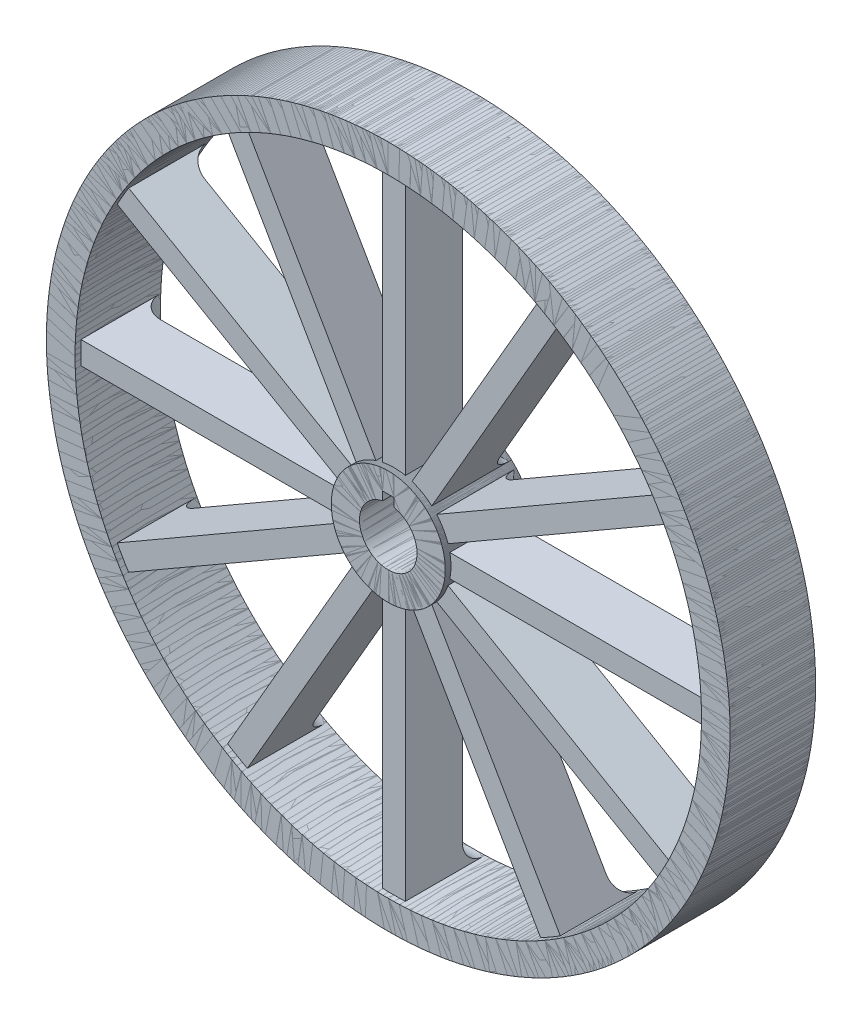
from build123d import *

# Parameters (mm, degrees)
SKETCH_1_R               = 60
SKETCH_1_R_2             = 55
EXTRUDE_1_DEPTH          = 15
SKETCH_1_R_3             = 10
SKETCH_1_R_4             = 5.05
EXTRUDE_1_2_DEPTH        = 15
EXTRUDE_2_DEPTH          = 14
CUT_EXTRUDE_1_DEPTH      = 4
PATTERN_CIRCULAR_1_COUNT = 12
CUT_EXTRUDE_2_DEPTH      = 97.184610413


with BuildPart() as part:
    # Sketch 1 → Extrude 1 (new body)
    with BuildSketch(Plane.XY):
        with Locations((-11.767184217, 2.257132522)):
            Circle(SKETCH_1_R)
        with Locations((-11.767184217, 2.257132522)):
            Circle(SKETCH_1_R_2, mode=Mode.SUBTRACT)
    extrude(amount=EXTRUDE_1_DEPTH)



with BuildPart() as body_2:
    # Sketch 1 → Extrude 1 2 (new body)
    with BuildSketch(Plane.XY):
        with Locations((-11.767184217, 2.257132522)):
            Circle(SKETCH_1_R_3)
        with Locations((-11.767184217, 2.257132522)):
            Circle(SKETCH_1_R_4, mode=Mode.SUBTRACT)
    extrude(amount=EXTRUDE_1_2_DEPTH)


with BuildPart() as part_1:
    add(part.part)

    add(body_2.part)  # Extrude 2 merges body 2
    # Sketch 1_3 → Extrude 2 (add)
    with BuildSketch(Plane.XY):
        with BuildLine():
            ThreePointArc((-9.767184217, 57.220756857), (-11.767184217, 57.257132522), (-13.767184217, 57.220756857))
            Line((-13.767184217, 57.220756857), (-13.767184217, 12.055091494))
            ThreePointArc((-13.767184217, 12.055091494), (-11.767184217, 12.257132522), (-9.767184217, 12.055091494))
            Line((-9.767184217, 12.055091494), (-9.767184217, 57.220756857))
        make_face()
    extrude(amount=EXTRUDE_2_DEPTH)

    # Sketch 2 → Cut-Extrude 1 (cut)
    with BuildSketch(Plane(origin=(-9.767184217, 0, 0), x_dir=(0, 0, -1), z_dir=(1, 0, 0))):
        with BuildLine():
            Line((0, 12.055091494), (0, 57.220756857))
            ThreePointArc((0, 57.220756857), (-2.828427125, 56.049183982), (-4, 53.220756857))
            Line((-4, 53.220756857), (-4, 16.055091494))
            ThreePointArc((-4, 16.055091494), (-2.828427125, 13.226664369), (0, 12.055091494))
        make_face()
    extrude(amount=-CUT_EXTRUDE_1_DEPTH, mode=Mode.SUBTRACT)


with BuildPart() as pattern_circular_1_1:
    # Pattern Circular 1: pattern copy
    add(part_1.part.rotate(Axis((-11.767184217, 2.257132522, 0), (0, 0, 1)), 1 * 360 / PATTERN_CIRCULAR_1_COUNT))


with BuildPart() as pattern_circular_1_2:
    # Pattern Circular 1: pattern copy
    add(part_1.part.rotate(Axis((-11.767184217, 2.257132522, 0), (0, 0, 1)), 2 * 360 / PATTERN_CIRCULAR_1_COUNT))


with BuildPart() as pattern_circular_1_3:
    # Pattern Circular 1: pattern copy
    add(part_1.part.rotate(Axis((-11.767184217, 2.257132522, 0), (0, 0, 1)), 3 * 360 / PATTERN_CIRCULAR_1_COUNT))


with BuildPart() as pattern_circular_1_4:
    # Pattern Circular 1: pattern copy
    add(part_1.part.rotate(Axis((-11.767184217, 2.257132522, 0), (0, 0, 1)), 4 * 360 / PATTERN_CIRCULAR_1_COUNT))


with BuildPart() as pattern_circular_1_5:
    # Pattern Circular 1: pattern copy
    add(part_1.part.rotate(Axis((-11.767184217, 2.257132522, 0), (0, 0, 1)), 5 * 360 / PATTERN_CIRCULAR_1_COUNT))


with BuildPart() as pattern_circular_1_6:
    # Pattern Circular 1: pattern copy
    add(part_1.part.rotate(Axis((-11.767184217, 2.257132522, 0), (0, 0, 1)), 6 * 360 / PATTERN_CIRCULAR_1_COUNT))


with BuildPart() as pattern_circular_1_7:
    # Pattern Circular 1: pattern copy
    add(part_1.part.rotate(Axis((-11.767184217, 2.257132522, 0), (0, 0, 1)), 7 * 360 / PATTERN_CIRCULAR_1_COUNT))


with BuildPart() as pattern_circular_1_8:
    # Pattern Circular 1: pattern copy
    add(part_1.part.rotate(Axis((-11.767184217, 2.257132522, 0), (0, 0, 1)), 8 * 360 / PATTERN_CIRCULAR_1_COUNT))


with BuildPart() as pattern_circular_1_9:
    # Pattern Circular 1: pattern copy
    add(part_1.part.rotate(Axis((-11.767184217, 2.257132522, 0), (0, 0, 1)), 9 * 360 / PATTERN_CIRCULAR_1_COUNT))


with BuildPart() as pattern_circular_1_10:
    # Pattern Circular 1: pattern copy
    add(part_1.part.rotate(Axis((-11.767184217, 2.257132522, 0), (0, 0, 1)), 10 * 360 / PATTERN_CIRCULAR_1_COUNT))


with BuildPart() as pattern_circular_1_11:
    # Pattern Circular 1: pattern copy
    add(part_1.part.rotate(Axis((-11.767184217, 2.257132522, 0), (0, 0, 1)), 11 * 360 / PATTERN_CIRCULAR_1_COUNT))


with BuildPart() as cut_extrude_2_tool:
    # Sketch 3 → Cut-Extrude 2 (new, through all)
    with BuildSketch(Plane(origin=(0, 0, 0), x_dir=(-1, 0, 0), z_dir=(0, 0, -1))):
        with BuildLine():
            Line((12.767184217, 8.707132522), (10.767184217, 8.707132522))
            Line((10.767184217, 8.707132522), (10.767184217, 7.207132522))
            ThreePointArc((10.767184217, 7.207132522), (11.767184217, 7.307132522), (12.767184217, 7.207132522))
            Line((12.767184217, 7.207132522), (12.767184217, 8.707132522))
        make_face()
    extrude(amount=-CUT_EXTRUDE_2_DEPTH)


with BuildPart() as part_2:
    add(part_1.part)

    # Cut-Extrude 2: cut by cut_extrude_2_tool
    add(cut_extrude_2_tool.part, mode=Mode.SUBTRACT)


with BuildPart() as pattern_circular_1_1_1:
    add(pattern_circular_1_1.part)

    # Cut-Extrude 2: cut by cut_extrude_2_tool
    add(cut_extrude_2_tool.part, mode=Mode.SUBTRACT)


with BuildPart() as pattern_circular_1_2_1:
    add(pattern_circular_1_2.part)

    # Cut-Extrude 2: cut by cut_extrude_2_tool
    add(cut_extrude_2_tool.part, mode=Mode.SUBTRACT)


with BuildPart() as pattern_circular_1_3_1:
    add(pattern_circular_1_3.part)

    # Cut-Extrude 2: cut by cut_extrude_2_tool
    add(cut_extrude_2_tool.part, mode=Mode.SUBTRACT)


with BuildPart() as pattern_circular_1_4_1:
    add(pattern_circular_1_4.part)

    # Cut-Extrude 2: cut by cut_extrude_2_tool
    add(cut_extrude_2_tool.part, mode=Mode.SUBTRACT)


with BuildPart() as pattern_circular_1_5_1:
    add(pattern_circular_1_5.part)

    # Cut-Extrude 2: cut by cut_extrude_2_tool
    add(cut_extrude_2_tool.part, mode=Mode.SUBTRACT)


with BuildPart() as pattern_circular_1_6_1:
    add(pattern_circular_1_6.part)

    # Cut-Extrude 2: cut by cut_extrude_2_tool
    add(cut_extrude_2_tool.part, mode=Mode.SUBTRACT)


with BuildPart() as pattern_circular_1_7_1:
    add(pattern_circular_1_7.part)

    # Cut-Extrude 2: cut by cut_extrude_2_tool
    add(cut_extrude_2_tool.part, mode=Mode.SUBTRACT)


with BuildPart() as pattern_circular_1_8_1:
    add(pattern_circular_1_8.part)

    # Cut-Extrude 2: cut by cut_extrude_2_tool
    add(cut_extrude_2_tool.part, mode=Mode.SUBTRACT)


with BuildPart() as pattern_circular_1_9_1:
    add(pattern_circular_1_9.part)

    # Cut-Extrude 2: cut by cut_extrude_2_tool
    add(cut_extrude_2_tool.part, mode=Mode.SUBTRACT)


with BuildPart() as pattern_circular_1_10_1:
    add(pattern_circular_1_10.part)

    # Cut-Extrude 2: cut by cut_extrude_2_tool
    add(cut_extrude_2_tool.part, mode=Mode.SUBTRACT)


with BuildPart() as pattern_circular_1_11_1:
    add(pattern_circular_1_11.part)

    # Cut-Extrude 2: cut by cut_extrude_2_tool
    add(cut_extrude_2_tool.part, mode=Mode.SUBTRACT)


solid = Compound([part_2.part, pattern_circular_1_1_1.part, pattern_circular_1_2_1.part, pattern_circular_1_3_1.part, pattern_circular_1_4_1.part, pattern_circular_1_5_1.part, pattern_circular_1_6_1.part, pattern_circular_1_7_1.part, pattern_circular_1_8_1.part, pattern_circular_1_9_1.part, pattern_circular_1_10_1.part, pattern_circular_1_11_1.part])
